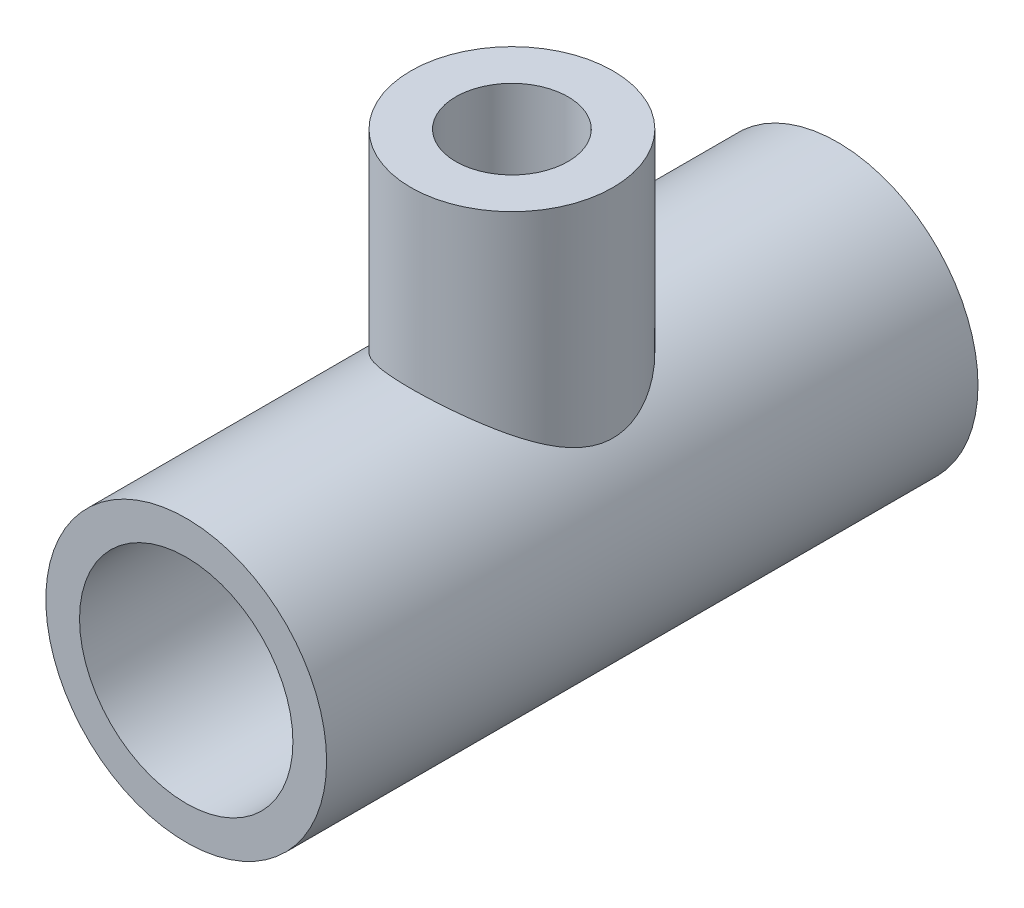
from build123d import *

# Parameters (mm, degrees)
ESQUISSE1_R             = 6.25
BOSS_EXTRU_1_DEPTH      = 29
ESQUISSE3_R             = 4.5
BOSS_EXTRU_2_DEPTH      = 14
ESQUISSE4_R             = 2.5
ENL_V_MAT_EXTRU_3_DEPTH = 6
ESQUISSE2_R             = 4.75
ENL_V_MAT_EXTRU_4_DEPTH = 119.78592704


with BuildPart() as part:
    # Esquisse1 → Boss.-Extru.1 (new body)
    with BuildSketch(Plane.XY):
        with Locations(Location((0, 0, 0), (0, 0, 180))):
            Circle(ESQUISSE1_R)
    extrude(amount=BOSS_EXTRU_1_DEPTH)

    # Esquisse3 → Boss.-Extru.2 (add)
    with BuildSketch(Plane(origin=(0, 0, 0), x_dir=(1, 0, 0), z_dir=(0, 1, 0))):
        with Locations(Location((0, -14.5, 0), (0, 0, 90))):
            Circle(ESQUISSE3_R)
    extrude(amount=BOSS_EXTRU_2_DEPTH)

    # Esquisse4 → Enl_v. mat.-Extru.3 (cut)
    with BuildSketch(Plane(origin=(0, 14, 0), x_dir=(1, 0, 0), z_dir=(0, 1, 0))):
        with Locations(Location((0, -14.5, 0), (0, 0, 270))):
            Circle(ESQUISSE4_R)
    extrude(amount=-ENL_V_MAT_EXTRU_3_DEPTH, mode=Mode.SUBTRACT)

    # Esquisse2 → Enl_v. mat.-Extru.4 (cut)
    with BuildSketch(Plane(origin=(0, 0, 0), x_dir=(-1, 0, 0), z_dir=(0, 0, -1))):
        Circle(ESQUISSE2_R)
    extrude(amount=-ENL_V_MAT_EXTRU_4_DEPTH, mode=Mode.SUBTRACT)


solid = part.part
